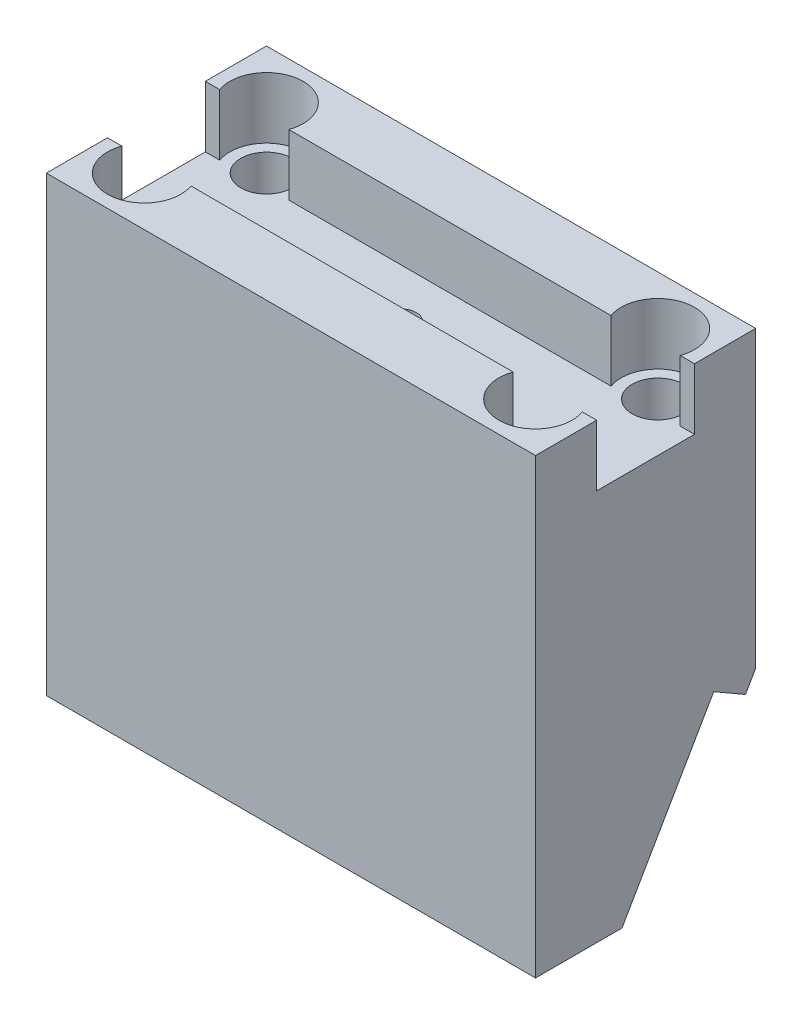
ISO-10303-21;
HEADER;
FILE_DESCRIPTION(('STEP AP214'),'2;1');
FILE_NAME('part.step','',(''),(''),'','','');
FILE_SCHEMA(('AUTOMOTIVE_DESIGN { 1 0 10303 214 1 1 1 1 }'));
ENDSEC;
DATA;
#1=APPLICATION_CONTEXT('core data for automotive mechanical design processes');
#2=APPLICATION_PROTOCOL_DEFINITION('international standard','automotive_design',2000,#1);
#3=PRODUCT_CONTEXT('',#1,'mechanical');
#4=PRODUCT('Part','Part','',(#3));
#5=PRODUCT_RELATED_PRODUCT_CATEGORY('part','',(#4));
#6=PRODUCT_DEFINITION_FORMATION('','',#4);
#7=PRODUCT_DEFINITION_CONTEXT('part definition',#1,'design');
#8=PRODUCT_DEFINITION('design','',#6,#7);
#9=PRODUCT_DEFINITION_SHAPE('','',#8);
#10=(LENGTH_UNIT() NAMED_UNIT(*) SI_UNIT(.MILLI.,.METRE.));
#11=(NAMED_UNIT(*) PLANE_ANGLE_UNIT() SI_UNIT($,.RADIAN.));
#12=(NAMED_UNIT(*) SI_UNIT($,.STERADIAN.) SOLID_ANGLE_UNIT());
#13=UNCERTAINTY_MEASURE_WITH_UNIT(LENGTH_MEASURE(1.E-05),#10,'distance_accuracy_value','');
#14=(GEOMETRIC_REPRESENTATION_CONTEXT(3) GLOBAL_UNCERTAINTY_ASSIGNED_CONTEXT((#13)) GLOBAL_UNIT_ASSIGNED_CONTEXT((#10,
#11,#12)) REPRESENTATION_CONTEXT('',''));
#15=CARTESIAN_POINT('',(0.,0.,0.));
#16=DIRECTION('',(0.,0.,1.));
#17=DIRECTION('',(1.,0.,0.));
#18=AXIS2_PLACEMENT_3D('',#15,#16,#17);
#19=CARTESIAN_POINT('',(40.,37.,-18.));
#20=DIRECTION('',(0.,-1.,0.));
#21=DIRECTION('',(0.,0.,-1.));
#22=AXIS2_PLACEMENT_3D('',#19,#20,#21);
#23=PLANE('',#22);
#24=DIRECTION('',(0.,0.,1.));
#25=VECTOR('',#24,1.);
#26=CARTESIAN_POINT('',(0.,37.,-18.));
#27=LINE('',#26,#25);
#28=CARTESIAN_POINT('',(0.,37.,-18.));
#29=VERTEX_POINT('',#28);
#30=CARTESIAN_POINT('',(0.,37.,-13.));
#31=VERTEX_POINT('',#30);
#32=EDGE_CURVE('E316',#29,#31,#27,.T.);
#33=ORIENTED_EDGE('',*,*,#32,.T.);
#34=DIRECTION('',(-1.,0.,0.));
#35=VECTOR('',#34,1.);
#36=CARTESIAN_POINT('',(-12.2693463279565,37.,-13.));
#37=LINE('',#36,#35);
#38=CARTESIAN_POINT('',(1.17157287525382,37.,-13.));
#39=VERTEX_POINT('',#38);
#40=EDGE_CURVE('E242',#39,#31,#37,.T.);
#41=ORIENTED_EDGE('',*,*,#40,.F.);
#42=CARTESIAN_POINT('',(4.,37.,-14.));
#43=DIRECTION('',(0.,1.,0.));
#44=DIRECTION('',(0.,0.,1.));
#45=AXIS2_PLACEMENT_3D('',#42,#43,#44);
#46=CIRCLE('',#45,3.);
#47=CARTESIAN_POINT('',(6.82842712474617,37.,-13.));
#48=VERTEX_POINT('',#47);
#49=EDGE_CURVE('E282',#48,#39,#46,.T.);
#50=ORIENTED_EDGE('',*,*,#49,.F.);
#51=CARTESIAN_POINT('',(33.1715728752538,37.,-13.));
#52=VERTEX_POINT('',#51);
#53=EDGE_CURVE('E244',#52,#48,#37,.T.);
#54=ORIENTED_EDGE('',*,*,#53,.F.);
#55=CARTESIAN_POINT('',(36.,37.,-14.));
#56=DIRECTION('',(0.,1.,0.));
#57=DIRECTION('',(0.,0.,1.));
#58=AXIS2_PLACEMENT_3D('',#55,#56,#57);
#59=CIRCLE('',#58,3.);
#60=CARTESIAN_POINT('',(38.8284271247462,37.,-13.));
#61=VERTEX_POINT('',#60);
#62=EDGE_CURVE('E272',#61,#52,#59,.T.);
#63=ORIENTED_EDGE('',*,*,#62,.F.);
#64=CARTESIAN_POINT('',(40.,37.,-13.));
#65=VERTEX_POINT('',#64);
#66=EDGE_CURVE('E233',#65,#61,#37,.T.);
#67=ORIENTED_EDGE('',*,*,#66,.F.);
#68=DIRECTION('',(0.,0.,1.));
#69=VECTOR('',#68,1.);
#70=CARTESIAN_POINT('',(40.,37.,-18.));
#71=LINE('',#70,#69);
#72=CARTESIAN_POINT('',(40.,37.,-18.));
#73=VERTEX_POINT('',#72);
#74=EDGE_CURVE('E324',#73,#65,#71,.T.);
#75=ORIENTED_EDGE('',*,*,#74,.F.);
#76=DIRECTION('',(-1.,0.,0.));
#77=VECTOR('',#76,1.);
#78=CARTESIAN_POINT('',(40.,37.,-18.));
#79=LINE('',#78,#77);
#80=EDGE_CURVE('E342',#73,#29,#79,.T.);
#81=ORIENTED_EDGE('',*,*,#80,.T.);
#82=EDGE_LOOP('',(#33,#41,#50,#54,#63,#67,#75,#81));
#83=FACE_BOUND('',#82,.T.);
#84=ADVANCED_FACE('F36',(#83),#23,.F.);
#85=CARTESIAN_POINT('',(40.,37.,0.));
#86=DIRECTION('',(0.,0.,-1.));
#87=DIRECTION('',(0.,1.,0.));
#88=AXIS2_PLACEMENT_3D('',#85,#86,#87);
#89=PLANE('',#88);
#90=DIRECTION('',(0.,-1.,0.));
#91=VECTOR('',#90,1.);
#92=CARTESIAN_POINT('',(0.,37.,0.));
#93=LINE('',#92,#91);
#94=CARTESIAN_POINT('',(0.,37.,0.));
#95=VERTEX_POINT('',#94);
#96=CARTESIAN_POINT('',(0.,0.,0.));
#97=VERTEX_POINT('',#96);
#98=EDGE_CURVE('E311',#95,#97,#93,.T.);
#99=ORIENTED_EDGE('',*,*,#98,.T.);
#100=DIRECTION('',(-1.,0.,0.));
#101=VECTOR('',#100,1.);
#102=CARTESIAN_POINT('',(40.,0.,0.));
#103=LINE('',#102,#101);
#104=CARTESIAN_POINT('',(40.,0.,0.));
#105=VERTEX_POINT('',#104);
#106=EDGE_CURVE('E348',#105,#97,#103,.T.);
#107=ORIENTED_EDGE('',*,*,#106,.F.);
#108=DIRECTION('',(0.,-1.,0.));
#109=VECTOR('',#108,1.);
#110=CARTESIAN_POINT('',(40.,37.,0.));
#111=LINE('',#110,#109);
#112=CARTESIAN_POINT('',(40.,37.,0.));
#113=VERTEX_POINT('',#112);
#114=EDGE_CURVE('E312',#113,#105,#111,.T.);
#115=ORIENTED_EDGE('',*,*,#114,.F.);
#116=DIRECTION('',(-1.,0.,0.));
#117=VECTOR('',#116,1.);
#118=CARTESIAN_POINT('',(40.,37.,0.));
#119=LINE('',#118,#117);
#120=EDGE_CURVE('E327',#113,#95,#119,.T.);
#121=ORIENTED_EDGE('',*,*,#120,.T.);
#122=EDGE_LOOP('',(#99,#107,#115,#121));
#123=FACE_BOUND('',#122,.T.);
#124=ADVANCED_FACE('F38',(#123),#89,.F.);
#125=CARTESIAN_POINT('',(40.,0.,0.));
#126=DIRECTION('',(0.,1.,0.));
#127=DIRECTION('',(0.,0.,1.));
#128=AXIS2_PLACEMENT_3D('',#125,#126,#127);
#129=PLANE('',#128);
#130=DIRECTION('',(0.,0.,-1.));
#131=VECTOR('',#130,1.);
#132=CARTESIAN_POINT('',(0.,0.,0.));
#133=LINE('',#132,#131);
#134=CARTESIAN_POINT('',(0.,0.,-7.07179676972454));
#135=VERTEX_POINT('',#134);
#136=EDGE_CURVE('E330',#97,#135,#133,.T.);
#137=ORIENTED_EDGE('',*,*,#136,.T.);
#138=DIRECTION('',(1.,0.,0.));
#139=VECTOR('',#138,1.);
#140=CARTESIAN_POINT('',(40.,0.,-7.07179676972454));
#141=LINE('',#140,#139);
#142=CARTESIAN_POINT('',(40.,0.,-7.07179676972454));
#143=VERTEX_POINT('',#142);
#144=EDGE_CURVE('E51',#135,#143,#141,.T.);
#145=ORIENTED_EDGE('',*,*,#144,.T.);
#146=DIRECTION('',(0.,0.,-1.));
#147=VECTOR('',#146,1.);
#148=CARTESIAN_POINT('',(40.,0.,0.));
#149=LINE('',#148,#147);
#150=EDGE_CURVE('E315',#105,#143,#149,.T.);
#151=ORIENTED_EDGE('',*,*,#150,.F.);
#152=ORIENTED_EDGE('',*,*,#106,.T.);
#153=EDGE_LOOP('',(#137,#145,#151,#152));
#154=FACE_BOUND('',#153,.T.);
#155=ADVANCED_FACE('F427',(#154),#129,.F.);
#156=CARTESIAN_POINT('',(40.,12.9282032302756,-18.));
#157=DIRECTION('',(0.,0.499999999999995,0.866025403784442));
#158=DIRECTION('',(0.,-0.866025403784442,0.499999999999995));
#159=AXIS2_PLACEMENT_3D('',#156,#157,#158);
#160=PLANE('',#159);
#161=DIRECTION('',(0.,0.866025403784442,-0.499999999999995));
#162=VECTOR('',#161,1.);
#163=CARTESIAN_POINT('',(40.,12.9282032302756,-18.));
#164=LINE('',#163,#162);
#165=CARTESIAN_POINT('',(40.,11.4903810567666,-17.1698729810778));
#166=VERTEX_POINT('',#165);
#167=CARTESIAN_POINT('',(40.,12.9282032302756,-18.));
#168=VERTEX_POINT('',#167);
#169=EDGE_CURVE('E319',#166,#168,#164,.T.);
#170=ORIENTED_EDGE('',*,*,#169,.F.);
#171=DIRECTION('',(-1.,0.,0.));
#172=VECTOR('',#171,1.);
#173=CARTESIAN_POINT('',(40.,11.4903810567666,-17.1698729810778));
#174=LINE('',#173,#172);
#175=CARTESIAN_POINT('',(0.,11.4903810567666,-17.1698729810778));
#176=VERTEX_POINT('',#175);
#177=EDGE_CURVE('E225',#166,#176,#174,.T.);
#178=ORIENTED_EDGE('',*,*,#177,.T.);
#179=DIRECTION('',(0.,0.866025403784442,-0.499999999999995));
#180=VECTOR('',#179,1.);
#181=CARTESIAN_POINT('',(0.,12.9282032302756,-18.));
#182=LINE('',#181,#180);
#183=CARTESIAN_POINT('',(0.,12.9282032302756,-18.));
#184=VERTEX_POINT('',#183);
#185=EDGE_CURVE('E333',#176,#184,#182,.T.);
#186=ORIENTED_EDGE('',*,*,#185,.T.);
#187=DIRECTION('',(-1.,0.,0.));
#188=VECTOR('',#187,1.);
#189=CARTESIAN_POINT('',(40.,12.9282032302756,-18.));
#190=LINE('',#189,#188);
#191=EDGE_CURVE('E345',#168,#184,#190,.T.);
#192=ORIENTED_EDGE('',*,*,#191,.F.);
#193=EDGE_LOOP('',(#170,#178,#186,#192));
#194=FACE_BOUND('',#193,.T.);
#195=ADVANCED_FACE('F437',(#194),#160,.F.);
#196=CARTESIAN_POINT('',(40.,12.9282032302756,-18.));
#197=DIRECTION('',(0.,0.,1.));
#198=DIRECTION('',(0.,-1.,0.));
#199=AXIS2_PLACEMENT_3D('',#196,#197,#198);
#200=PLANE('',#199);
#201=DIRECTION('',(0.,1.,0.));
#202=VECTOR('',#201,1.);
#203=CARTESIAN_POINT('',(0.,12.9282032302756,-18.));
#204=LINE('',#203,#202);
#205=EDGE_CURVE('E335',#184,#29,#204,.T.);
#206=ORIENTED_EDGE('',*,*,#205,.T.);
#207=ORIENTED_EDGE('',*,*,#80,.F.);
#208=DIRECTION('',(0.,1.,0.));
#209=VECTOR('',#208,1.);
#210=CARTESIAN_POINT('',(40.,12.9282032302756,-18.));
#211=LINE('',#210,#209);
#212=EDGE_CURVE('E321',#168,#73,#211,.T.);
#213=ORIENTED_EDGE('',*,*,#212,.F.);
#214=ORIENTED_EDGE('',*,*,#191,.T.);
#215=EDGE_LOOP('',(#206,#207,#213,#214));
#216=FACE_BOUND('',#215,.T.);
#217=ADVANCED_FACE('F431',(#216),#200,.F.);
#218=CARTESIAN_POINT('',(40.,37.,-4.99999999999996));
#219=VERTEX_POINT('',#218);
#220=EDGE_CURVE('E323',#219,#113,#71,.T.);
#221=ORIENTED_EDGE('',*,*,#220,.F.);
#222=DIRECTION('',(1.,0.,0.));
#223=VECTOR('',#222,1.);
#224=CARTESIAN_POINT('',(-12.2693463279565,37.,-4.99999999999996));
#225=LINE('',#224,#223);
#226=CARTESIAN_POINT('',(38.8284271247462,37.,-4.99999999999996));
#227=VERTEX_POINT('',#226);
#228=EDGE_CURVE('E228',#227,#219,#225,.T.);
#229=ORIENTED_EDGE('',*,*,#228,.F.);
#230=CARTESIAN_POINT('',(36.,37.,-4.00000000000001));
#231=DIRECTION('',(0.,1.,0.));
#232=DIRECTION('',(0.,0.,1.));
#233=AXIS2_PLACEMENT_3D('',#230,#231,#232);
#234=CIRCLE('',#233,3.);
#235=CARTESIAN_POINT('',(33.1715728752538,37.,-4.99999999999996));
#236=VERTEX_POINT('',#235);
#237=EDGE_CURVE('E289',#236,#227,#234,.T.);
#238=ORIENTED_EDGE('',*,*,#237,.F.);
#239=CARTESIAN_POINT('',(6.8284271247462,37.,-4.99999999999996));
#240=VERTEX_POINT('',#239);
#241=EDGE_CURVE('E240',#240,#236,#225,.T.);
#242=ORIENTED_EDGE('',*,*,#241,.F.);
#243=CARTESIAN_POINT('',(4.,37.,-4.00000000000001));
#244=DIRECTION('',(0.,1.,0.));
#245=DIRECTION('',(0.,0.,1.));
#246=AXIS2_PLACEMENT_3D('',#243,#244,#245);
#247=CIRCLE('',#246,3.);
#248=CARTESIAN_POINT('',(1.17157287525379,37.,-4.99999999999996));
#249=VERTEX_POINT('',#248);
#250=EDGE_CURVE('E301',#249,#240,#247,.T.);
#251=ORIENTED_EDGE('',*,*,#250,.F.);
#252=CARTESIAN_POINT('',(0.,37.,-4.99999999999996));
#253=VERTEX_POINT('',#252);
#254=EDGE_CURVE('E241',#253,#249,#225,.T.);
#255=ORIENTED_EDGE('',*,*,#254,.F.);
#256=EDGE_CURVE('E337',#253,#95,#27,.T.);
#257=ORIENTED_EDGE('',*,*,#256,.T.);
#258=ORIENTED_EDGE('',*,*,#120,.F.);
#259=EDGE_LOOP('',(#221,#229,#238,#242,#251,#255,#257,#258));
#260=FACE_BOUND('',#259,.T.);
#261=ADVANCED_FACE('F390',(#260),#23,.F.);
#262=CARTESIAN_POINT('',(40.,0.,0.));
#263=DIRECTION('',(1.,0.,0.));
#264=DIRECTION('',(0.,0.,-1.));
#265=AXIS2_PLACEMENT_3D('',#262,#263,#264);
#266=PLANE('',#265);
#267=DIRECTION('',(0.,-0.5,-0.866025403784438));
#268=VECTOR('',#267,1.);
#269=CARTESIAN_POINT('',(40.,12.9903810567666,-14.5717967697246));
#270=LINE('',#269,#268);
#271=CARTESIAN_POINT('',(40.,12.9903810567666,-14.5717967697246));
#272=VERTEX_POINT('',#271);
#273=EDGE_CURVE('E214',#272,#166,#270,.T.);
#274=ORIENTED_EDGE('',*,*,#273,.T.);
#275=ORIENTED_EDGE('',*,*,#169,.T.);
#276=ORIENTED_EDGE('',*,*,#212,.T.);
#277=ORIENTED_EDGE('',*,*,#74,.T.);
#278=DIRECTION('',(0.,1.,0.));
#279=VECTOR('',#278,1.);
#280=CARTESIAN_POINT('',(40.,0.,-13.));
#281=LINE('',#280,#279);
#282=CARTESIAN_POINT('',(40.,32.,-13.));
#283=VERTEX_POINT('',#282);
#284=EDGE_CURVE('E259',#283,#65,#281,.T.);
#285=ORIENTED_EDGE('',*,*,#284,.F.);
#286=DIRECTION('',(0.,0.,1.));
#287=VECTOR('',#286,1.);
#288=CARTESIAN_POINT('',(40.,32.,0.));
#289=LINE('',#288,#287);
#290=CARTESIAN_POINT('',(40.,32.,-4.99999999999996));
#291=VERTEX_POINT('',#290);
#292=EDGE_CURVE('E247',#283,#291,#289,.T.);
#293=ORIENTED_EDGE('',*,*,#292,.T.);
#294=DIRECTION('',(0.,-1.,0.));
#295=VECTOR('',#294,1.);
#296=CARTESIAN_POINT('',(40.,0.,-4.99999999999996));
#297=LINE('',#296,#295);
#298=EDGE_CURVE('E270',#219,#291,#297,.T.);
#299=ORIENTED_EDGE('',*,*,#298,.F.);
#300=ORIENTED_EDGE('',*,*,#220,.T.);
#301=ORIENTED_EDGE('',*,*,#114,.T.);
#302=ORIENTED_EDGE('',*,*,#150,.T.);
#303=DIRECTION('',(0.,0.866025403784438,-0.5));
#304=VECTOR('',#303,1.);
#305=CARTESIAN_POINT('',(40.,12.9903810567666,-14.5717967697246));
#306=LINE('',#305,#304);
#307=EDGE_CURVE('E217',#143,#272,#306,.T.);
#308=ORIENTED_EDGE('',*,*,#307,.T.);
#309=EDGE_LOOP('',(#274,#275,#276,#277,#285,#293,#299,#300,#301,#302,#308));
#310=FACE_BOUND('',#309,.T.);
#311=ADVANCED_FACE('F404',(#310),#266,.T.);
#312=CARTESIAN_POINT('',(0.,0.,0.));
#313=DIRECTION('',(1.,0.,0.));
#314=DIRECTION('',(0.,0.,-1.));
#315=AXIS2_PLACEMENT_3D('',#312,#313,#314);
#316=PLANE('',#315);
#317=ORIENTED_EDGE('',*,*,#185,.F.);
#318=DIRECTION('',(0.,-0.5,-0.866025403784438));
#319=VECTOR('',#318,1.);
#320=CARTESIAN_POINT('',(0.,12.9903810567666,-14.5717967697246));
#321=LINE('',#320,#319);
#322=CARTESIAN_POINT('',(0.,12.9903810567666,-14.5717967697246));
#323=VERTEX_POINT('',#322);
#324=EDGE_CURVE('E213',#323,#176,#321,.T.);
#325=ORIENTED_EDGE('',*,*,#324,.F.);
#326=DIRECTION('',(0.,-0.866025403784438,0.5));
#327=VECTOR('',#326,1.);
#328=CARTESIAN_POINT('',(0.,-3.06217782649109,-5.3038475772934));
#329=LINE('',#328,#327);
#330=EDGE_CURVE('E11',#323,#135,#329,.T.);
#331=ORIENTED_EDGE('',*,*,#330,.T.);
#332=ORIENTED_EDGE('',*,*,#136,.F.);
#333=ORIENTED_EDGE('',*,*,#98,.F.);
#334=ORIENTED_EDGE('',*,*,#256,.F.);
#335=DIRECTION('',(0.,-1.,0.));
#336=VECTOR('',#335,1.);
#337=CARTESIAN_POINT('',(0.,0.,-4.99999999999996));
#338=LINE('',#337,#336);
#339=CARTESIAN_POINT('',(0.,32.,-4.99999999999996));
#340=VERTEX_POINT('',#339);
#341=EDGE_CURVE('E267',#253,#340,#338,.T.);
#342=ORIENTED_EDGE('',*,*,#341,.T.);
#343=DIRECTION('',(0.,0.,1.));
#344=VECTOR('',#343,1.);
#345=CARTESIAN_POINT('',(0.,32.,0.));
#346=LINE('',#345,#344);
#347=CARTESIAN_POINT('',(0.,32.,-13.));
#348=VERTEX_POINT('',#347);
#349=EDGE_CURVE('E245',#348,#340,#346,.T.);
#350=ORIENTED_EDGE('',*,*,#349,.F.);
#351=DIRECTION('',(0.,1.,0.));
#352=VECTOR('',#351,1.);
#353=CARTESIAN_POINT('',(0.,0.,-13.));
#354=LINE('',#353,#352);
#355=EDGE_CURVE('E256',#348,#31,#354,.T.);
#356=ORIENTED_EDGE('',*,*,#355,.T.);
#357=ORIENTED_EDGE('',*,*,#32,.F.);
#358=ORIENTED_EDGE('',*,*,#205,.F.);
#359=EDGE_LOOP('',(#317,#325,#331,#332,#333,#334,#342,#350,#356,#357,#358));
#360=FACE_BOUND('',#359,.T.);
#361=ADVANCED_FACE('F398',(#360),#316,.F.);
#362=CARTESIAN_POINT('',(4.,32.,-4.00000000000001));
#363=DIRECTION('',(0.,1.,0.));
#364=DIRECTION('',(0.,0.,1.));
#365=AXIS2_PLACEMENT_3D('',#362,#363,#364);
#366=PLANE('',#365);
#367=CARTESIAN_POINT('',(20.,32.,-8.99999999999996));
#368=DIRECTION('',(0.,1.,0.));
#369=DIRECTION('',(0.,0.,1.));
#370=AXIS2_PLACEMENT_3D('',#367,#368,#369);
#371=CIRCLE('',#370,1.24999999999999);
#372=CARTESIAN_POINT('',(20.,32.,-7.74999999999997));
#373=VERTEX_POINT('',#372);
#374=EDGE_CURVE('E197',#373,#373,#371,.T.);
#375=ORIENTED_EDGE('',*,*,#374,.F.);
#376=EDGE_LOOP('',(#375));
#377=FACE_BOUND('',#376,.T.);
#378=CARTESIAN_POINT('',(4.,32.,-4.00000000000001));
#379=DIRECTION('',(0.,1.,0.));
#380=DIRECTION('',(0.,0.,1.));
#381=AXIS2_PLACEMENT_3D('',#378,#379,#380);
#382=CIRCLE('',#381,2.1);
#383=CARTESIAN_POINT('',(4.,32.,-1.90000000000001));
#384=VERTEX_POINT('',#383);
#385=EDGE_CURVE('E305',#384,#384,#382,.F.);
#386=ORIENTED_EDGE('',*,*,#385,.T.);
#387=EDGE_LOOP('',(#386));
#388=FACE_BOUND('',#387,.T.);
#389=DIRECTION('',(1.,0.,0.));
#390=VECTOR('',#389,1.);
#391=CARTESIAN_POINT('',(-12.2693463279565,32.,-4.99999999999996));
#392=LINE('',#391,#390);
#393=CARTESIAN_POINT('',(1.17157287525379,32.,-4.99999999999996));
#394=VERTEX_POINT('',#393);
#395=EDGE_CURVE('E234',#340,#394,#392,.T.);
#396=ORIENTED_EDGE('',*,*,#395,.T.);
#397=CARTESIAN_POINT('',(4.,32.,-4.00000000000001));
#398=DIRECTION('',(0.,1.,0.));
#399=DIRECTION('',(0.,0.,1.));
#400=AXIS2_PLACEMENT_3D('',#397,#398,#399);
#401=CIRCLE('',#400,3.);
#402=CARTESIAN_POINT('',(6.8284271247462,32.,-4.99999999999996));
#403=VERTEX_POINT('',#402);
#404=EDGE_CURVE('E302',#394,#403,#401,.T.);
#405=ORIENTED_EDGE('',*,*,#404,.T.);
#406=CARTESIAN_POINT('',(33.1715728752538,32.,-4.99999999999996));
#407=VERTEX_POINT('',#406);
#408=EDGE_CURVE('E232',#403,#407,#392,.T.);
#409=ORIENTED_EDGE('',*,*,#408,.T.);
#410=CARTESIAN_POINT('',(36.,32.,-4.00000000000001));
#411=DIRECTION('',(0.,1.,0.));
#412=DIRECTION('',(0.,0.,1.));
#413=AXIS2_PLACEMENT_3D('',#410,#411,#412);
#414=CIRCLE('',#413,3.);
#415=CARTESIAN_POINT('',(38.8284271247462,32.,-4.99999999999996));
#416=VERTEX_POINT('',#415);
#417=EDGE_CURVE('E285',#407,#416,#414,.T.);
#418=ORIENTED_EDGE('',*,*,#417,.T.);
#419=EDGE_CURVE('E229',#416,#291,#392,.T.);
#420=ORIENTED_EDGE('',*,*,#419,.T.);
#421=ORIENTED_EDGE('',*,*,#292,.F.);
#422=DIRECTION('',(-1.,0.,0.));
#423=VECTOR('',#422,1.);
#424=CARTESIAN_POINT('',(-12.2693463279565,32.,-13.));
#425=LINE('',#424,#423);
#426=CARTESIAN_POINT('',(38.8284271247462,32.,-13.));
#427=VERTEX_POINT('',#426);
#428=EDGE_CURVE('E58',#283,#427,#425,.T.);
#429=ORIENTED_EDGE('',*,*,#428,.T.);
#430=CARTESIAN_POINT('',(36.,32.,-14.));
#431=DIRECTION('',(0.,1.,0.));
#432=DIRECTION('',(0.,0.,1.));
#433=AXIS2_PLACEMENT_3D('',#430,#431,#432);
#434=CIRCLE('',#433,3.);
#435=CARTESIAN_POINT('',(33.1715728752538,32.,-13.));
#436=VERTEX_POINT('',#435);
#437=EDGE_CURVE('E273',#427,#436,#434,.T.);
#438=ORIENTED_EDGE('',*,*,#437,.T.);
#439=CARTESIAN_POINT('',(6.82842712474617,32.,-13.));
#440=VERTEX_POINT('',#439);
#441=EDGE_CURVE('E238',#436,#440,#425,.T.);
#442=ORIENTED_EDGE('',*,*,#441,.T.);
#443=CARTESIAN_POINT('',(4.,32.,-14.));
#444=DIRECTION('',(0.,1.,0.));
#445=DIRECTION('',(0.,0.,1.));
#446=AXIS2_PLACEMENT_3D('',#443,#444,#445);
#447=CIRCLE('',#446,3.);
#448=CARTESIAN_POINT('',(1.17157287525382,32.,-13.));
#449=VERTEX_POINT('',#448);
#450=EDGE_CURVE('E278',#440,#449,#447,.T.);
#451=ORIENTED_EDGE('',*,*,#450,.T.);
#452=EDGE_CURVE('E235',#449,#348,#425,.T.);
#453=ORIENTED_EDGE('',*,*,#452,.T.);
#454=ORIENTED_EDGE('',*,*,#349,.T.);
#455=EDGE_LOOP('',(#396,#405,#409,#418,#420,#421,#429,#438,#442,#451,#453,#454));
#456=FACE_BOUND('',#455,.T.);
#457=CARTESIAN_POINT('',(36.,32.,-4.00000000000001));
#458=DIRECTION('',(0.,1.,0.));
#459=DIRECTION('',(0.,0.,1.));
#460=AXIS2_PLACEMENT_3D('',#457,#458,#459);
#461=CIRCLE('',#460,2.1);
#462=CARTESIAN_POINT('',(36.,32.,-1.90000000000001));
#463=VERTEX_POINT('',#462);
#464=EDGE_CURVE('E288',#463,#463,#461,.F.);
#465=ORIENTED_EDGE('',*,*,#464,.T.);
#466=EDGE_LOOP('',(#465));
#467=FACE_BOUND('',#466,.T.);
#468=CARTESIAN_POINT('',(4.,32.,-14.));
#469=DIRECTION('',(0.,1.,0.));
#470=DIRECTION('',(0.,0.,1.));
#471=AXIS2_PLACEMENT_3D('',#468,#469,#470);
#472=CIRCLE('',#471,2.1);
#473=CARTESIAN_POINT('',(4.,32.,-11.9));
#474=VERTEX_POINT('',#473);
#475=EDGE_CURVE('E281',#474,#474,#472,.F.);
#476=ORIENTED_EDGE('',*,*,#475,.T.);
#477=EDGE_LOOP('',(#476));
#478=FACE_BOUND('',#477,.T.);
#479=CARTESIAN_POINT('',(36.,32.,-14.));
#480=DIRECTION('',(0.,1.,0.));
#481=DIRECTION('',(0.,0.,1.));
#482=AXIS2_PLACEMENT_3D('',#479,#480,#481);
#483=CIRCLE('',#482,2.1);
#484=CARTESIAN_POINT('',(36.,32.,-11.9));
#485=VERTEX_POINT('',#484);
#486=EDGE_CURVE('E275',#485,#485,#483,.F.);
#487=ORIENTED_EDGE('',*,*,#486,.T.);
#488=EDGE_LOOP('',(#487));
#489=FACE_BOUND('',#488,.T.);
#490=ADVANCED_FACE('F376',(#377,#388,#456,#467,#478,#489),#366,.T.);
#491=CARTESIAN_POINT('',(4.,32.,-4.00000000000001));
#492=DIRECTION('',(0.,1.,0.));
#493=DIRECTION('',(0.,0.,1.));
#494=AXIS2_PLACEMENT_3D('',#491,#492,#493);
#495=CYLINDRICAL_SURFACE('',#494,3.);
#496=ORIENTED_EDGE('',*,*,#250,.T.);
#497=DIRECTION('',(0.,1.,0.));
#498=VECTOR('',#497,1.);
#499=CARTESIAN_POINT('',(6.8284271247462,32.,-4.99999999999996));
#500=LINE('',#499,#498);
#501=EDGE_CURVE('E264',#240,#403,#500,.F.);
#502=ORIENTED_EDGE('',*,*,#501,.T.);
#503=ORIENTED_EDGE('',*,*,#404,.F.);
#504=DIRECTION('',(0.,1.,0.));
#505=VECTOR('',#504,1.);
#506=CARTESIAN_POINT('',(1.17157287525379,32.,-4.99999999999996));
#507=LINE('',#506,#505);
#508=EDGE_CURVE('E261',#394,#249,#507,.T.);
#509=ORIENTED_EDGE('',*,*,#508,.T.);
#510=EDGE_LOOP('',(#496,#502,#503,#509));
#511=FACE_BOUND('',#510,.T.);
#512=ADVANCED_FACE('F384',(#511),#495,.F.);
#513=CARTESIAN_POINT('',(4.,21.6,-4.00000000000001));
#514=DIRECTION('',(0.,1.,0.));
#515=DIRECTION('',(0.,0.,1.));
#516=AXIS2_PLACEMENT_3D('',#513,#514,#515);
#517=CONICAL_SURFACE('',#516,2.1,1.02974425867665);
#518=CARTESIAN_POINT('',(4.,20.3381927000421,-4.00000000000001));
#519=VERTEX_POINT('',#518);
#520=VERTEX_LOOP('',#519);
#521=FACE_BOUND('',#520,.T.);
#522=CARTESIAN_POINT('',(4.,21.6,-4.00000000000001));
#523=DIRECTION('',(0.,1.,0.));
#524=DIRECTION('',(0.,0.,1.));
#525=AXIS2_PLACEMENT_3D('',#522,#523,#524);
#526=CIRCLE('',#525,2.1);
#527=CARTESIAN_POINT('',(4.,21.6,-1.90000000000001));
#528=VERTEX_POINT('',#527);
#529=EDGE_CURVE('E308',#528,#528,#526,.T.);
#530=ORIENTED_EDGE('',*,*,#529,.T.);
#531=EDGE_LOOP('',(#530));
#532=FACE_BOUND('',#531,.T.);
#533=ADVANCED_FACE('F512',(#521,#532),#517,.F.);
#534=CARTESIAN_POINT('',(4.,37.,-4.00000000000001));
#535=DIRECTION('',(0.,1.,0.));
#536=DIRECTION('',(0.,0.,1.));
#537=AXIS2_PLACEMENT_3D('',#534,#535,#536);
#538=CYLINDRICAL_SURFACE('',#537,2.1);
#539=ORIENTED_EDGE('',*,*,#529,.F.);
#540=EDGE_LOOP('',(#539));
#541=FACE_BOUND('',#540,.T.);
#542=ORIENTED_EDGE('',*,*,#385,.F.);
#543=EDGE_LOOP('',(#542));
#544=FACE_BOUND('',#543,.T.);
#545=ADVANCED_FACE('F510',(#541,#544),#538,.F.);
#546=CARTESIAN_POINT('',(36.,32.,-4.00000000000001));
#547=DIRECTION('',(0.,1.,0.));
#548=DIRECTION('',(0.,0.,1.));
#549=AXIS2_PLACEMENT_3D('',#546,#547,#548);
#550=CYLINDRICAL_SURFACE('',#549,3.);
#551=ORIENTED_EDGE('',*,*,#237,.T.);
#552=DIRECTION('',(0.,1.,0.));
#553=VECTOR('',#552,1.);
#554=CARTESIAN_POINT('',(38.8284271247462,32.,-4.99999999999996));
#555=LINE('',#554,#553);
#556=EDGE_CURVE('E44',#227,#416,#555,.F.);
#557=ORIENTED_EDGE('',*,*,#556,.T.);
#558=ORIENTED_EDGE('',*,*,#417,.F.);
#559=DIRECTION('',(0.,1.,0.));
#560=VECTOR('',#559,1.);
#561=CARTESIAN_POINT('',(33.1715728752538,32.,-4.99999999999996));
#562=LINE('',#561,#560);
#563=EDGE_CURVE('E365',#407,#236,#562,.T.);
#564=ORIENTED_EDGE('',*,*,#563,.T.);
#565=EDGE_LOOP('',(#551,#557,#558,#564));
#566=FACE_BOUND('',#565,.T.);
#567=ADVANCED_FACE('F370',(#566),#550,.F.);
#568=CARTESIAN_POINT('',(36.,21.6,-4.00000000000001));
#569=DIRECTION('',(0.,1.,0.));
#570=DIRECTION('',(0.,0.,1.));
#571=AXIS2_PLACEMENT_3D('',#568,#569,#570);
#572=CONICAL_SURFACE('',#571,2.1,1.02974425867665);
#573=CARTESIAN_POINT('',(36.,20.3381927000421,-4.00000000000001));
#574=VERTEX_POINT('',#573);
#575=VERTEX_LOOP('',#574);
#576=FACE_BOUND('',#575,.T.);
#577=CARTESIAN_POINT('',(36.,21.6,-4.00000000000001));
#578=DIRECTION('',(0.,1.,0.));
#579=DIRECTION('',(0.,0.,1.));
#580=AXIS2_PLACEMENT_3D('',#577,#578,#579);
#581=CIRCLE('',#580,2.1);
#582=CARTESIAN_POINT('',(36.,21.6,-1.90000000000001));
#583=VERTEX_POINT('',#582);
#584=EDGE_CURVE('E298',#583,#583,#581,.T.);
#585=ORIENTED_EDGE('',*,*,#584,.T.);
#586=EDGE_LOOP('',(#585));
#587=FACE_BOUND('',#586,.T.);
#588=ADVANCED_FACE('F519',(#576,#587),#572,.F.);
#589=CARTESIAN_POINT('',(36.,37.,-4.00000000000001));
#590=DIRECTION('',(0.,1.,0.));
#591=DIRECTION('',(0.,0.,1.));
#592=AXIS2_PLACEMENT_3D('',#589,#590,#591);
#593=CYLINDRICAL_SURFACE('',#592,2.1);
#594=ORIENTED_EDGE('',*,*,#584,.F.);
#595=EDGE_LOOP('',(#594));
#596=FACE_BOUND('',#595,.T.);
#597=ORIENTED_EDGE('',*,*,#464,.F.);
#598=EDGE_LOOP('',(#597));
#599=FACE_BOUND('',#598,.T.);
#600=ADVANCED_FACE('F559',(#596,#599),#593,.F.);
#601=CARTESIAN_POINT('',(4.,32.,-14.));
#602=DIRECTION('',(0.,1.,0.));
#603=DIRECTION('',(0.,0.,1.));
#604=AXIS2_PLACEMENT_3D('',#601,#602,#603);
#605=CYLINDRICAL_SURFACE('',#604,3.);
#606=ORIENTED_EDGE('',*,*,#49,.T.);
#607=DIRECTION('',(0.,1.,0.));
#608=VECTOR('',#607,1.);
#609=CARTESIAN_POINT('',(1.17157287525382,32.,-13.));
#610=LINE('',#609,#608);
#611=EDGE_CURVE('E253',#39,#449,#610,.F.);
#612=ORIENTED_EDGE('',*,*,#611,.T.);
#613=ORIENTED_EDGE('',*,*,#450,.F.);
#614=DIRECTION('',(0.,1.,0.));
#615=VECTOR('',#614,1.);
#616=CARTESIAN_POINT('',(6.82842712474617,32.,-13.));
#617=LINE('',#616,#615);
#618=EDGE_CURVE('E250',#440,#48,#617,.T.);
#619=ORIENTED_EDGE('',*,*,#618,.T.);
#620=EDGE_LOOP('',(#606,#612,#613,#619));
#621=FACE_BOUND('',#620,.T.);
#622=ADVANCED_FACE('F469',(#621),#605,.F.);
#623=CARTESIAN_POINT('',(4.,21.6,-14.));
#624=DIRECTION('',(0.,1.,0.));
#625=DIRECTION('',(0.,0.,1.));
#626=AXIS2_PLACEMENT_3D('',#623,#624,#625);
#627=CONICAL_SURFACE('',#626,2.1,1.02974425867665);
#628=CARTESIAN_POINT('',(4.,20.3381927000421,-14.));
#629=VERTEX_POINT('',#628);
#630=VERTEX_LOOP('',#629);
#631=FACE_BOUND('',#630,.T.);
#632=CARTESIAN_POINT('',(4.,21.6,-14.));
#633=DIRECTION('',(0.,1.,0.));
#634=DIRECTION('',(0.,0.,1.));
#635=AXIS2_PLACEMENT_3D('',#632,#633,#634);
#636=CIRCLE('',#635,2.1);
#637=CARTESIAN_POINT('',(4.,21.6,-11.9));
#638=VERTEX_POINT('',#637);
#639=EDGE_CURVE('E295',#638,#638,#636,.T.);
#640=ORIENTED_EDGE('',*,*,#639,.T.);
#641=EDGE_LOOP('',(#640));
#642=FACE_BOUND('',#641,.T.);
#643=ADVANCED_FACE('F567',(#631,#642),#627,.F.);
#644=CARTESIAN_POINT('',(4.,37.,-14.));
#645=DIRECTION('',(0.,1.,0.));
#646=DIRECTION('',(0.,0.,1.));
#647=AXIS2_PLACEMENT_3D('',#644,#645,#646);
#648=CYLINDRICAL_SURFACE('',#647,2.1);
#649=ORIENTED_EDGE('',*,*,#639,.F.);
#650=EDGE_LOOP('',(#649));
#651=FACE_BOUND('',#650,.T.);
#652=ORIENTED_EDGE('',*,*,#475,.F.);
#653=EDGE_LOOP('',(#652));
#654=FACE_BOUND('',#653,.T.);
#655=ADVANCED_FACE('F571',(#651,#654),#648,.F.);
#656=CARTESIAN_POINT('',(36.,32.,-14.));
#657=DIRECTION('',(0.,1.,0.));
#658=DIRECTION('',(0.,0.,1.));
#659=AXIS2_PLACEMENT_3D('',#656,#657,#658);
#660=CYLINDRICAL_SURFACE('',#659,3.);
#661=ORIENTED_EDGE('',*,*,#62,.T.);
#662=DIRECTION('',(0.,1.,0.));
#663=VECTOR('',#662,1.);
#664=CARTESIAN_POINT('',(33.1715728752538,32.,-13.));
#665=LINE('',#664,#663);
#666=EDGE_CURVE('E362',#52,#436,#665,.F.);
#667=ORIENTED_EDGE('',*,*,#666,.T.);
#668=ORIENTED_EDGE('',*,*,#437,.F.);
#669=DIRECTION('',(0.,1.,0.));
#670=VECTOR('',#669,1.);
#671=CARTESIAN_POINT('',(38.8284271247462,32.,-13.));
#672=LINE('',#671,#670);
#673=EDGE_CURVE('E351',#427,#61,#672,.T.);
#674=ORIENTED_EDGE('',*,*,#673,.T.);
#675=EDGE_LOOP('',(#661,#667,#668,#674));
#676=FACE_BOUND('',#675,.T.);
#677=ADVANCED_FACE('F473',(#676),#660,.F.);
#678=CARTESIAN_POINT('',(36.,21.6,-14.));
#679=DIRECTION('',(0.,1.,0.));
#680=DIRECTION('',(0.,0.,1.));
#681=AXIS2_PLACEMENT_3D('',#678,#679,#680);
#682=CONICAL_SURFACE('',#681,2.1,1.02974425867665);
#683=CARTESIAN_POINT('',(36.,20.3381927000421,-14.));
#684=VERTEX_POINT('',#683);
#685=VERTEX_LOOP('',#684);
#686=FACE_BOUND('',#685,.T.);
#687=CARTESIAN_POINT('',(36.,21.6,-14.));
#688=DIRECTION('',(0.,1.,0.));
#689=DIRECTION('',(0.,0.,1.));
#690=AXIS2_PLACEMENT_3D('',#687,#688,#689);
#691=CIRCLE('',#690,2.1);
#692=CARTESIAN_POINT('',(36.,21.6,-11.9));
#693=VERTEX_POINT('',#692);
#694=EDGE_CURVE('E292',#693,#693,#691,.T.);
#695=ORIENTED_EDGE('',*,*,#694,.T.);
#696=EDGE_LOOP('',(#695));
#697=FACE_BOUND('',#696,.T.);
#698=ADVANCED_FACE('F580',(#686,#697),#682,.F.);
#699=CARTESIAN_POINT('',(36.,37.,-14.));
#700=DIRECTION('',(0.,1.,0.));
#701=DIRECTION('',(0.,0.,1.));
#702=AXIS2_PLACEMENT_3D('',#699,#700,#701);
#703=CYLINDRICAL_SURFACE('',#702,2.1);
#704=ORIENTED_EDGE('',*,*,#694,.F.);
#705=EDGE_LOOP('',(#704));
#706=FACE_BOUND('',#705,.T.);
#707=ORIENTED_EDGE('',*,*,#486,.F.);
#708=EDGE_LOOP('',(#707));
#709=FACE_BOUND('',#708,.T.);
#710=ADVANCED_FACE('F420',(#706,#709),#703,.F.);
#711=CARTESIAN_POINT('',(-12.2693463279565,32.,-4.99999999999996));
#712=DIRECTION('',(0.,0.,1.));
#713=DIRECTION('',(1.,0.,0.));
#714=AXIS2_PLACEMENT_3D('',#711,#712,#713);
#715=PLANE('',#714);
#716=ORIENTED_EDGE('',*,*,#254,.T.);
#717=ORIENTED_EDGE('',*,*,#508,.F.);
#718=ORIENTED_EDGE('',*,*,#395,.F.);
#719=ORIENTED_EDGE('',*,*,#341,.F.);
#720=EDGE_LOOP('',(#716,#717,#718,#719));
#721=FACE_BOUND('',#720,.T.);
#722=ADVANCED_FACE('F392',(#721),#715,.F.);
#723=ORIENTED_EDGE('',*,*,#241,.T.);
#724=ORIENTED_EDGE('',*,*,#563,.F.);
#725=ORIENTED_EDGE('',*,*,#408,.F.);
#726=ORIENTED_EDGE('',*,*,#501,.F.);
#727=EDGE_LOOP('',(#723,#724,#725,#726));
#728=FACE_BOUND('',#727,.T.);
#729=ADVANCED_FACE('F387',(#728),#715,.F.);
#730=ORIENTED_EDGE('',*,*,#298,.T.);
#731=ORIENTED_EDGE('',*,*,#419,.F.);
#732=ORIENTED_EDGE('',*,*,#556,.F.);
#733=ORIENTED_EDGE('',*,*,#228,.T.);
#734=EDGE_LOOP('',(#730,#731,#732,#733));
#735=FACE_BOUND('',#734,.T.);
#736=ADVANCED_FACE('F406',(#735),#715,.F.);
#737=CARTESIAN_POINT('',(-12.2693463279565,32.,-13.));
#738=DIRECTION('',(0.,0.,-1.));
#739=DIRECTION('',(-1.,0.,0.));
#740=AXIS2_PLACEMENT_3D('',#737,#738,#739);
#741=PLANE('',#740);
#742=ORIENTED_EDGE('',*,*,#452,.F.);
#743=ORIENTED_EDGE('',*,*,#611,.F.);
#744=ORIENTED_EDGE('',*,*,#40,.T.);
#745=ORIENTED_EDGE('',*,*,#355,.F.);
#746=EDGE_LOOP('',(#742,#743,#744,#745));
#747=FACE_BOUND('',#746,.T.);
#748=ADVANCED_FACE('F408',(#747),#741,.F.);
#749=ORIENTED_EDGE('',*,*,#441,.F.);
#750=ORIENTED_EDGE('',*,*,#666,.F.);
#751=ORIENTED_EDGE('',*,*,#53,.T.);
#752=ORIENTED_EDGE('',*,*,#618,.F.);
#753=EDGE_LOOP('',(#749,#750,#751,#752));
#754=FACE_BOUND('',#753,.T.);
#755=ADVANCED_FACE('F414',(#754),#741,.F.);
#756=ORIENTED_EDGE('',*,*,#284,.T.);
#757=ORIENTED_EDGE('',*,*,#66,.T.);
#758=ORIENTED_EDGE('',*,*,#673,.F.);
#759=ORIENTED_EDGE('',*,*,#428,.F.);
#760=EDGE_LOOP('',(#756,#757,#758,#759));
#761=FACE_BOUND('',#760,.T.);
#762=ADVANCED_FACE('F417',(#761),#741,.F.);
#763=CARTESIAN_POINT('',(40.,12.9903810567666,-14.5717967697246));
#764=DIRECTION('',(0.,0.866025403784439,-0.5));
#765=DIRECTION('',(0.,0.5,0.866025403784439));
#766=AXIS2_PLACEMENT_3D('',#763,#764,#765);
#767=PLANE('',#766);
#768=ORIENTED_EDGE('',*,*,#273,.F.);
#769=DIRECTION('',(-1.,0.,0.));
#770=VECTOR('',#769,1.);
#771=CARTESIAN_POINT('',(40.,12.9903810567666,-14.5717967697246));
#772=LINE('',#771,#770);
#773=EDGE_CURVE('E220',#272,#323,#772,.T.);
#774=ORIENTED_EDGE('',*,*,#773,.T.);
#775=ORIENTED_EDGE('',*,*,#324,.T.);
#776=ORIENTED_EDGE('',*,*,#177,.F.);
#777=EDGE_LOOP('',(#768,#774,#775,#776));
#778=FACE_BOUND('',#777,.T.);
#779=ADVANCED_FACE('F453',(#778),#767,.F.);
#780=CARTESIAN_POINT('',(40.,12.9903810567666,-14.5717967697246));
#781=DIRECTION('',(0.,0.5,0.866025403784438));
#782=DIRECTION('',(0.,-0.866025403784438,0.5));
#783=AXIS2_PLACEMENT_3D('',#780,#781,#782);
#784=PLANE('',#783);
#785=CARTESIAN_POINT('',(10.,6.49519052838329,-10.8217967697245));
#786=DIRECTION('',(0.,-0.5,-0.866025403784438));
#787=DIRECTION('',(0.,0.866025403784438,-0.5));
#788=AXIS2_PLACEMENT_3D('',#785,#786,#787);
#789=CIRCLE('',#788,1.25);
#790=CARTESIAN_POINT('',(10.,7.57772228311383,-11.4467967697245));
#791=VERTEX_POINT('',#790);
#792=EDGE_CURVE('E196',#791,#791,#789,.T.);
#793=ORIENTED_EDGE('',*,*,#792,.F.);
#794=EDGE_LOOP('',(#793));
#795=FACE_BOUND('',#794,.T.);
#796=CARTESIAN_POINT('',(30.,6.49519052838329,-10.8217967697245));
#797=DIRECTION('',(0.,-0.5,-0.866025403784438));
#798=DIRECTION('',(0.,0.866025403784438,-0.5));
#799=AXIS2_PLACEMENT_3D('',#796,#797,#798);
#800=CIRCLE('',#799,1.25);
#801=CARTESIAN_POINT('',(30.,7.57772228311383,-11.4467967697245));
#802=VERTEX_POINT('',#801);
#803=EDGE_CURVE('E207',#802,#802,#800,.T.);
#804=ORIENTED_EDGE('',*,*,#803,.F.);
#805=EDGE_LOOP('',(#804));
#806=FACE_BOUND('',#805,.T.);
#807=ORIENTED_EDGE('',*,*,#330,.F.);
#808=ORIENTED_EDGE('',*,*,#773,.F.);
#809=ORIENTED_EDGE('',*,*,#307,.F.);
#810=ORIENTED_EDGE('',*,*,#144,.F.);
#811=EDGE_LOOP('',(#807,#808,#809,#810));
#812=FACE_BOUND('',#811,.T.);
#813=ADVANCED_FACE('F450',(#795,#806,#812),#784,.F.);
#814=CARTESIAN_POINT('',(30.,10.2451905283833,-4.32660624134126));
#815=DIRECTION('',(0.,-0.5,-0.866025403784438));
#816=DIRECTION('',(0.,0.866025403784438,-0.5));
#817=AXIS2_PLACEMENT_3D('',#814,#815,#816);
#818=CONICAL_SURFACE('',#817,1.25,1.02974425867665);
#819=CARTESIAN_POINT('',(30.,10.6207284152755,-3.67615554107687));
#820=VERTEX_POINT('',#819);
#821=VERTEX_LOOP('',#820);
#822=FACE_BOUND('',#821,.T.);
#823=CARTESIAN_POINT('',(30.,10.2451905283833,-4.32660624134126));
#824=DIRECTION('',(0.,-0.5,-0.866025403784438));
#825=DIRECTION('',(0.,0.866025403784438,-0.5));
#826=AXIS2_PLACEMENT_3D('',#823,#824,#825);
#827=CIRCLE('',#826,1.25);
#828=CARTESIAN_POINT('',(30.,11.3277222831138,-4.95160624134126));
#829=VERTEX_POINT('',#828);
#830=EDGE_CURVE('E210',#829,#829,#827,.T.);
#831=ORIENTED_EDGE('',*,*,#830,.T.);
#832=EDGE_LOOP('',(#831));
#833=FACE_BOUND('',#832,.T.);
#834=ADVANCED_FACE('F483',(#822,#833),#818,.F.);
#835=CARTESIAN_POINT('',(30.,6.49519052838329,-10.8217967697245));
#836=DIRECTION('',(0.,-0.5,-0.866025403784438));
#837=DIRECTION('',(0.,0.866025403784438,-0.5));
#838=AXIS2_PLACEMENT_3D('',#835,#836,#837);
#839=CYLINDRICAL_SURFACE('',#838,1.25);
#840=ORIENTED_EDGE('',*,*,#830,.F.);
#841=EDGE_LOOP('',(#840));
#842=FACE_BOUND('',#841,.T.);
#843=ORIENTED_EDGE('',*,*,#803,.T.);
#844=EDGE_LOOP('',(#843));
#845=FACE_BOUND('',#844,.T.);
#846=ADVANCED_FACE('F487',(#842,#845),#839,.F.);
#847=CARTESIAN_POINT('',(10.,10.2451905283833,-4.32660624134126));
#848=DIRECTION('',(0.,-0.5,-0.866025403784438));
#849=DIRECTION('',(0.,0.866025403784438,-0.5));
#850=AXIS2_PLACEMENT_3D('',#847,#848,#849);
#851=CONICAL_SURFACE('',#850,1.25,1.02974425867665);
#852=CARTESIAN_POINT('',(10.,10.6207284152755,-3.67615554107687));
#853=VERTEX_POINT('',#852);
#854=VERTEX_LOOP('',#853);
#855=FACE_BOUND('',#854,.T.);
#856=CARTESIAN_POINT('',(10.,10.2451905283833,-4.32660624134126));
#857=DIRECTION('',(0.,-0.5,-0.866025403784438));
#858=DIRECTION('',(0.,0.866025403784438,-0.5));
#859=AXIS2_PLACEMENT_3D('',#856,#857,#858);
#860=CIRCLE('',#859,1.25);
#861=CARTESIAN_POINT('',(10.,11.3277222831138,-4.95160624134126));
#862=VERTEX_POINT('',#861);
#863=EDGE_CURVE('E200',#862,#862,#860,.T.);
#864=ORIENTED_EDGE('',*,*,#863,.T.);
#865=EDGE_LOOP('',(#864));
#866=FACE_BOUND('',#865,.T.);
#867=ADVANCED_FACE('F491',(#855,#866),#851,.F.);
#868=CARTESIAN_POINT('',(10.,6.49519052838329,-10.8217967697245));
#869=DIRECTION('',(0.,-0.5,-0.866025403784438));
#870=DIRECTION('',(0.,0.866025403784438,-0.5));
#871=AXIS2_PLACEMENT_3D('',#868,#869,#870);
#872=CYLINDRICAL_SURFACE('',#871,1.25);
#873=ORIENTED_EDGE('',*,*,#863,.F.);
#874=EDGE_LOOP('',(#873));
#875=FACE_BOUND('',#874,.T.);
#876=ORIENTED_EDGE('',*,*,#792,.T.);
#877=EDGE_LOOP('',(#876));
#878=FACE_BOUND('',#877,.T.);
#879=ADVANCED_FACE('F190',(#875,#878),#872,.F.);
#880=CARTESIAN_POINT('',(20.,19.,-8.99999999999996));
#881=DIRECTION('',(0.,1.,0.));
#882=DIRECTION('',(0.,0.,1.));
#883=AXIS2_PLACEMENT_3D('',#880,#881,#882);
#884=CONICAL_SURFACE('',#883,1.25,1.02974425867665);
#885=CARTESIAN_POINT('',(20.,18.2489242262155,-8.99999999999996));
#886=VERTEX_POINT('',#885);
#887=VERTEX_LOOP('',#886);
#888=FACE_BOUND('',#887,.T.);
#889=CARTESIAN_POINT('',(20.,19.,-8.99999999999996));
#890=DIRECTION('',(0.,1.,0.));
#891=DIRECTION('',(0.,0.,1.));
#892=AXIS2_PLACEMENT_3D('',#889,#890,#891);
#893=CIRCLE('',#892,1.25);
#894=CARTESIAN_POINT('',(20.,19.,-7.74999999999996));
#895=VERTEX_POINT('',#894);
#896=EDGE_CURVE('E194',#895,#895,#893,.T.);
#897=ORIENTED_EDGE('',*,*,#896,.T.);
#898=EDGE_LOOP('',(#897));
#899=FACE_BOUND('',#898,.T.);
#900=ADVANCED_FACE('F186',(#888,#899),#884,.F.);
#901=CARTESIAN_POINT('',(20.,32.,-8.99999999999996));
#902=DIRECTION('',(0.,1.,0.));
#903=DIRECTION('',(0.,0.,1.));
#904=AXIS2_PLACEMENT_3D('',#901,#902,#903);
#905=CYLINDRICAL_SURFACE('',#904,1.24999999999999);
#906=ORIENTED_EDGE('',*,*,#896,.F.);
#907=EDGE_LOOP('',(#906));
#908=FACE_BOUND('',#907,.T.);
#909=ORIENTED_EDGE('',*,*,#374,.T.);
#910=EDGE_LOOP('',(#909));
#911=FACE_BOUND('',#910,.T.);
#912=ADVANCED_FACE('F189',(#908,#911),#905,.F.);
#913=CLOSED_SHELL('',(#84,#124,#155,#195,#217,#261,#311,#361,#490,#512,#533,#545,#567,#588,#600,
#622,#643,#655,#677,#698,#710,#722,#729,#736,#748,#755,#762,#779,#813,#834,#846,#867,#879,#900,#912));
#914=MANIFOLD_SOLID_BREP('B2',#913);
#915=ADVANCED_BREP_SHAPE_REPRESENTATION('',(#18,#914),#14);
#916=SHAPE_DEFINITION_REPRESENTATION(#9,#915);
ENDSEC;
END-ISO-10303-21;
